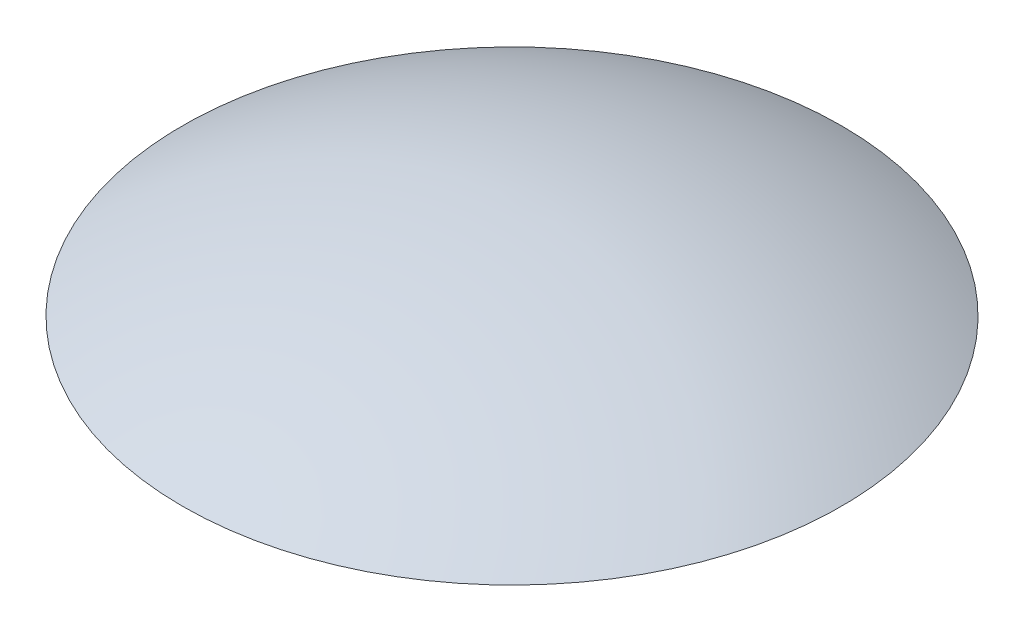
ISO-10303-21;
HEADER;
FILE_DESCRIPTION(('STEP AP214'),'2;1');
FILE_NAME('part.step','',(''),(''),'','','');
FILE_SCHEMA(('AUTOMOTIVE_DESIGN { 1 0 10303 214 1 1 1 1 }'));
ENDSEC;
DATA;
#1=APPLICATION_CONTEXT('core data for automotive mechanical design processes');
#2=APPLICATION_PROTOCOL_DEFINITION('international standard','automotive_design',2000,#1);
#3=PRODUCT_CONTEXT('',#1,'mechanical');
#4=PRODUCT('Part','Part','',(#3));
#5=PRODUCT_RELATED_PRODUCT_CATEGORY('part','',(#4));
#6=PRODUCT_DEFINITION_FORMATION('','',#4);
#7=PRODUCT_DEFINITION_CONTEXT('part definition',#1,'design');
#8=PRODUCT_DEFINITION('design','',#6,#7);
#9=PRODUCT_DEFINITION_SHAPE('','',#8);
#10=(LENGTH_UNIT() NAMED_UNIT(*) SI_UNIT(.MILLI.,.METRE.));
#11=(NAMED_UNIT(*) PLANE_ANGLE_UNIT() SI_UNIT($,.RADIAN.));
#12=(NAMED_UNIT(*) SI_UNIT($,.STERADIAN.) SOLID_ANGLE_UNIT());
#13=UNCERTAINTY_MEASURE_WITH_UNIT(LENGTH_MEASURE(1.E-05),#10,'distance_accuracy_value','');
#14=(GEOMETRIC_REPRESENTATION_CONTEXT(3) GLOBAL_UNCERTAINTY_ASSIGNED_CONTEXT((#13)) GLOBAL_UNIT_ASSIGNED_CONTEXT((#10,
#11,#12)) REPRESENTATION_CONTEXT('',''));
#15=CARTESIAN_POINT('',(0.,0.,0.));
#16=DIRECTION('',(0.,0.,1.));
#17=DIRECTION('',(1.,0.,0.));
#18=AXIS2_PLACEMENT_3D('',#15,#16,#17);
#19=CARTESIAN_POINT('',(0.,0.,0.));
#20=DIRECTION('',(0.,-1.,0.));
#21=DIRECTION('',(0.,0.,-1.));
#22=AXIS2_PLACEMENT_3D('',#19,#20,#21);
#23=PLANE('',#22);
#24=DIRECTION('',(0.,0.,1.));
#25=VECTOR('',#24,1.);
#26=CARTESIAN_POINT('',(-0.749999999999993,0.,-16.6414213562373));
#27=LINE('',#26,#25);
#28=CARTESIAN_POINT('',(-0.749999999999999,0.,0.750000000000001));
#29=VERTEX_POINT('',#28);
#30=CARTESIAN_POINT('',(-0.75,0.,3.));
#31=VERTEX_POINT('',#30);
#32=EDGE_CURVE('E117',#29,#31,#27,.T.);
#33=ORIENTED_EDGE('',*,*,#32,.T.);
#34=DIRECTION('',(1.,0.,0.));
#35=VECTOR('',#34,1.);
#36=CARTESIAN_POINT('',(0.,0.,3.));
#37=LINE('',#36,#35);
#38=CARTESIAN_POINT('',(0.75,0.,3.));
#39=VERTEX_POINT('',#38);
#40=EDGE_CURVE('E121',#31,#39,#37,.T.);
#41=ORIENTED_EDGE('',*,*,#40,.T.);
#42=DIRECTION('',(0.,0.,-1.));
#43=VECTOR('',#42,1.);
#44=CARTESIAN_POINT('',(0.750000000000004,0.,-16.6414213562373));
#45=LINE('',#44,#43);
#46=CARTESIAN_POINT('',(0.750000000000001,0.,0.750000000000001));
#47=VERTEX_POINT('',#46);
#48=EDGE_CURVE('E138',#39,#47,#45,.T.);
#49=ORIENTED_EDGE('',*,*,#48,.T.);
#50=DIRECTION('',(1.,0.,0.));
#51=VECTOR('',#50,1.);
#52=CARTESIAN_POINT('',(0.,0.,0.750000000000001));
#53=LINE('',#52,#51);
#54=CARTESIAN_POINT('',(3.,0.,0.750000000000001));
#55=VERTEX_POINT('',#54);
#56=EDGE_CURVE('E142',#47,#55,#53,.T.);
#57=ORIENTED_EDGE('',*,*,#56,.T.);
#58=DIRECTION('',(0.,0.,-1.));
#59=VECTOR('',#58,1.);
#60=CARTESIAN_POINT('',(3.,0.,-16.6414213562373));
#61=LINE('',#60,#59);
#62=CARTESIAN_POINT('',(3.,0.,-0.749999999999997));
#63=VERTEX_POINT('',#62);
#64=EDGE_CURVE('E210',#55,#63,#61,.T.);
#65=ORIENTED_EDGE('',*,*,#64,.T.);
#66=DIRECTION('',(-1.,0.,0.));
#67=VECTOR('',#66,1.);
#68=CARTESIAN_POINT('',(0.,0.,-0.750000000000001));
#69=LINE('',#68,#67);
#70=CARTESIAN_POINT('',(0.750000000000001,0.,-0.750000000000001));
#71=VERTEX_POINT('',#70);
#72=EDGE_CURVE('E216',#63,#71,#69,.T.);
#73=ORIENTED_EDGE('',*,*,#72,.T.);
#74=DIRECTION('',(0.,0.,-1.));
#75=VECTOR('',#74,1.);
#76=CARTESIAN_POINT('',(0.75,0.,-16.6414213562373));
#77=LINE('',#76,#75);
#78=CARTESIAN_POINT('',(0.750000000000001,0.,-3.));
#79=VERTEX_POINT('',#78);
#80=EDGE_CURVE('E218',#71,#79,#77,.T.);
#81=ORIENTED_EDGE('',*,*,#80,.T.);
#82=DIRECTION('',(1.,0.,0.));
#83=VECTOR('',#82,1.);
#84=CARTESIAN_POINT('',(0.,0.,-3.));
#85=LINE('',#84,#83);
#86=CARTESIAN_POINT('',(-0.749999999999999,0.,-3.));
#87=VERTEX_POINT('',#86);
#88=EDGE_CURVE('E222',#87,#79,#85,.T.);
#89=ORIENTED_EDGE('',*,*,#88,.F.);
#90=DIRECTION('',(0.,0.,1.));
#91=VECTOR('',#90,1.);
#92=CARTESIAN_POINT('',(-0.749999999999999,0.,-16.6414213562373));
#93=LINE('',#92,#91);
#94=CARTESIAN_POINT('',(-0.749999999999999,0.,-0.750000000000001));
#95=VERTEX_POINT('',#94);
#96=EDGE_CURVE('E225',#87,#95,#93,.T.);
#97=ORIENTED_EDGE('',*,*,#96,.T.);
#98=DIRECTION('',(-1.,0.,0.));
#99=VECTOR('',#98,1.);
#100=CARTESIAN_POINT('',(0.,0.,-0.750000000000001));
#101=LINE('',#100,#99);
#102=CARTESIAN_POINT('',(-3.,0.,-0.750000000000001));
#103=VERTEX_POINT('',#102);
#104=EDGE_CURVE('E227',#95,#103,#101,.T.);
#105=ORIENTED_EDGE('',*,*,#104,.T.);
#106=DIRECTION('',(0.,0.,-1.));
#107=VECTOR('',#106,1.);
#108=CARTESIAN_POINT('',(-3.,0.,-16.6414213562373));
#109=LINE('',#108,#107);
#110=CARTESIAN_POINT('',(-3.,0.,0.749999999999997));
#111=VERTEX_POINT('',#110);
#112=EDGE_CURVE('E51',#111,#103,#109,.T.);
#113=ORIENTED_EDGE('',*,*,#112,.F.);
#114=DIRECTION('',(1.,0.,0.));
#115=VECTOR('',#114,1.);
#116=CARTESIAN_POINT('',(0.,0.,0.750000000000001));
#117=LINE('',#116,#115);
#118=EDGE_CURVE('E46',#111,#29,#117,.T.);
#119=ORIENTED_EDGE('',*,*,#118,.T.);
#120=EDGE_LOOP('',(#33,#41,#49,#57,#65,#73,#81,#89,#97,#105,#113,#119));
#121=FACE_BOUND('',#120,.T.);
#122=CARTESIAN_POINT('',(0.,0.,0.));
#123=DIRECTION('',(0.,1.,0.));
#124=DIRECTION('',(0.,0.,1.));
#125=AXIS2_PLACEMENT_3D('',#122,#123,#124);
#126=CIRCLE('',#125,7.5);
#127=CARTESIAN_POINT('',(0.,0.,7.5));
#128=VERTEX_POINT('',#127);
#129=EDGE_CURVE('E11',#128,#128,#126,.T.);
#130=ORIENTED_EDGE('',*,*,#129,.F.);
#131=EDGE_LOOP('',(#130));
#132=FACE_BOUND('',#131,.T.);
#133=ADVANCED_FACE('F32',(#121,#132),#23,.T.);
#134=CARTESIAN_POINT('',(0.,-13.0625,0.));
#135=DIRECTION('',(0.,1.,0.));
#136=DIRECTION('',(0.,0.,-1.));
#137=AXIS2_PLACEMENT_3D('',#134,#135,#136);
#138=SPHERICAL_SURFACE('',#137,15.0625);
#139=ORIENTED_EDGE('',*,*,#129,.T.);
#140=EDGE_LOOP('',(#139));
#141=FACE_BOUND('',#140,.T.);
#142=ADVANCED_FACE('F263',(#141),#138,.T.);
#143=CARTESIAN_POINT('',(-0.749999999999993,0.,-16.6414213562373));
#144=DIRECTION('',(-0.996194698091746,-0.0871557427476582,0.));
#145=DIRECTION('',(0.0871557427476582,-0.996194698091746,0.));
#146=AXIS2_PLACEMENT_3D('',#143,#144,#145);
#147=PLANE('',#146);
#148=ORIENTED_EDGE('',*,*,#32,.F.);
#149=DIRECTION('',(-0.0868265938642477,0.992432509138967,0.0868265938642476));
#150=VECTOR('',#149,1.);
#151=CARTESIAN_POINT('',(-0.618888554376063,-1.49861068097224,0.618888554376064));
#152=LINE('',#151,#150);
#153=CARTESIAN_POINT('',(-0.575022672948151,-2.,0.575022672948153));
#154=VERTEX_POINT('',#153);
#155=EDGE_CURVE('E39',#154,#29,#152,.T.);
#156=ORIENTED_EDGE('',*,*,#155,.F.);
#157=DIRECTION('',(0.,0.,1.));
#158=VECTOR('',#157,1.);
#159=CARTESIAN_POINT('',(-0.575022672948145,-2.,-16.6414213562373));
#160=LINE('',#159,#158);
#161=CARTESIAN_POINT('',(-0.575022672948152,-2.,2.82502267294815));
#162=VERTEX_POINT('',#161);
#163=EDGE_CURVE('E129',#154,#162,#160,.T.);
#164=ORIENTED_EDGE('',*,*,#163,.T.);
#165=DIRECTION('',(-0.0868265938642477,0.992432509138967,0.0868265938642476));
#166=VECTOR('',#165,1.);
#167=CARTESIAN_POINT('',(-0.601926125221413,-1.69249213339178,2.85192612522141));
#168=LINE('',#167,#166);
#169=EDGE_CURVE('E126',#162,#31,#168,.T.);
#170=ORIENTED_EDGE('',*,*,#169,.T.);
#171=EDGE_LOOP('',(#148,#156,#164,#170));
#172=FACE_BOUND('',#171,.T.);
#173=ADVANCED_FACE('F127',(#172),#147,.T.);
#174=CARTESIAN_POINT('',(0.,0.,0.750000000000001));
#175=DIRECTION('',(0.,-0.0871557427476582,0.996194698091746));
#176=DIRECTION('',(0.,-0.996194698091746,-0.0871557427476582));
#177=AXIS2_PLACEMENT_3D('',#174,#175,#176);
#178=PLANE('',#177);
#179=ORIENTED_EDGE('',*,*,#118,.F.);
#180=DIRECTION('',(0.0868265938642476,-0.992432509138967,-0.0868265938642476));
#181=VECTOR('',#180,1.);
#182=CARTESIAN_POINT('',(-2.9773834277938,-0.258508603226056,0.7273834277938));
#183=LINE('',#182,#181);
#184=CARTESIAN_POINT('',(-2.82502267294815,-2.,0.575022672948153));
#185=VERTEX_POINT('',#184);
#186=EDGE_CURVE('E146',#185,#111,#183,.F.);
#187=ORIENTED_EDGE('',*,*,#186,.F.);
#188=DIRECTION('',(1.,0.,0.));
#189=VECTOR('',#188,1.);
#190=CARTESIAN_POINT('',(0.,-2.,0.575022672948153));
#191=LINE('',#190,#189);
#192=EDGE_CURVE('E140',#185,#154,#191,.T.);
#193=ORIENTED_EDGE('',*,*,#192,.T.);
#194=ORIENTED_EDGE('',*,*,#155,.T.);
#195=EDGE_LOOP('',(#179,#187,#193,#194));
#196=FACE_BOUND('',#195,.T.);
#197=ADVANCED_FACE('F235',(#196),#178,.T.);
#198=CARTESIAN_POINT('',(-3.,0.,-16.6414213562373));
#199=DIRECTION('',(-0.996194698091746,-0.0871557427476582,0.));
#200=DIRECTION('',(0.0871557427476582,-0.996194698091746,0.));
#201=AXIS2_PLACEMENT_3D('',#198,#199,#200);
#202=PLANE('',#201);
#203=ORIENTED_EDGE('',*,*,#112,.T.);
#204=DIRECTION('',(0.0868265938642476,-0.992432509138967,0.0868265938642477));
#205=VECTOR('',#204,1.);
#206=CARTESIAN_POINT('',(-3.11980315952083,1.36935637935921,-0.869803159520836));
#207=LINE('',#206,#205);
#208=CARTESIAN_POINT('',(-2.82502267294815,-2.,-0.575022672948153));
#209=VERTEX_POINT('',#208);
#210=EDGE_CURVE('E170',#209,#103,#207,.F.);
#211=ORIENTED_EDGE('',*,*,#210,.F.);
#212=DIRECTION('',(0.,0.,1.));
#213=VECTOR('',#212,1.);
#214=CARTESIAN_POINT('',(-2.82502267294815,-2.,-16.6414213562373));
#215=LINE('',#214,#213);
#216=EDGE_CURVE('E176',#185,#209,#215,.F.);
#217=ORIENTED_EDGE('',*,*,#216,.F.);
#218=ORIENTED_EDGE('',*,*,#186,.T.);
#219=EDGE_LOOP('',(#203,#211,#217,#218));
#220=FACE_BOUND('',#219,.T.);
#221=ADVANCED_FACE('F232',(#220),#202,.T.);
#222=CARTESIAN_POINT('',(0.,0.,-0.750000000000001));
#223=DIRECTION('',(0.,-0.0871557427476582,-0.996194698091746));
#224=DIRECTION('',(0.,0.996194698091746,-0.0871557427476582));
#225=AXIS2_PLACEMENT_3D('',#222,#223,#224);
#226=PLANE('',#225);
#227=ORIENTED_EDGE('',*,*,#104,.F.);
#228=DIRECTION('',(-0.0868265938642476,0.992432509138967,-0.0868265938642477));
#229=VECTOR('',#228,1.);
#230=CARTESIAN_POINT('',(-0.744345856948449,-0.0646271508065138,-0.74434585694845));
#231=LINE('',#230,#229);
#232=CARTESIAN_POINT('',(-0.575022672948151,-2.,-0.575022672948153));
#233=VERTEX_POINT('',#232);
#234=EDGE_CURVE('E167',#233,#95,#231,.T.);
#235=ORIENTED_EDGE('',*,*,#234,.F.);
#236=DIRECTION('',(-1.,0.,0.));
#237=VECTOR('',#236,1.);
#238=CARTESIAN_POINT('',(0.,-2.,-0.575022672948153));
#239=LINE('',#238,#237);
#240=EDGE_CURVE('E178',#233,#209,#239,.T.);
#241=ORIENTED_EDGE('',*,*,#240,.T.);
#242=ORIENTED_EDGE('',*,*,#210,.T.);
#243=EDGE_LOOP('',(#227,#235,#241,#242));
#244=FACE_BOUND('',#243,.T.);
#245=ADVANCED_FACE('F277',(#244),#226,.T.);
#246=CARTESIAN_POINT('',(-0.749999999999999,0.,-16.6414213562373));
#247=DIRECTION('',(-0.996194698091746,-0.0871557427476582,0.));
#248=DIRECTION('',(0.0871557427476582,-0.996194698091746,0.));
#249=AXIS2_PLACEMENT_3D('',#246,#247,#248);
#250=PLANE('',#249);
#251=ORIENTED_EDGE('',*,*,#96,.F.);
#252=DIRECTION('',(0.0868265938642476,-0.992432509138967,0.0868265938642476));
#253=VECTOR('',#252,1.);
#254=CARTESIAN_POINT('',(-0.852840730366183,1.17547492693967,-3.10284073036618));
#255=LINE('',#254,#253);
#256=CARTESIAN_POINT('',(-0.575022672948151,-2.,-2.82502267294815));
#257=VERTEX_POINT('',#256);
#258=EDGE_CURVE('E164',#257,#87,#255,.F.);
#259=ORIENTED_EDGE('',*,*,#258,.F.);
#260=DIRECTION('',(0.,0.,1.));
#261=VECTOR('',#260,1.);
#262=CARTESIAN_POINT('',(-0.575022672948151,-2.,-16.6414213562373));
#263=LINE('',#262,#261);
#264=EDGE_CURVE('E181',#257,#233,#263,.T.);
#265=ORIENTED_EDGE('',*,*,#264,.T.);
#266=ORIENTED_EDGE('',*,*,#234,.T.);
#267=EDGE_LOOP('',(#251,#259,#265,#266));
#268=FACE_BOUND('',#267,.T.);
#269=ADVANCED_FACE('F241',(#268),#250,.T.);
#270=CARTESIAN_POINT('',(0.,0.,-3.));
#271=DIRECTION('',(0.,-0.0871557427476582,-0.996194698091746));
#272=DIRECTION('',(0.,0.996194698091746,-0.0871557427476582));
#273=AXIS2_PLACEMENT_3D('',#270,#271,#272);
#274=PLANE('',#273);
#275=ORIENTED_EDGE('',*,*,#88,.T.);
#276=DIRECTION('',(-0.0868265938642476,-0.992432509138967,0.0868265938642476));
#277=VECTOR('',#276,1.);
#278=CARTESIAN_POINT('',(0.744345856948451,-0.064627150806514,-2.99434585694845));
#279=LINE('',#278,#277);
#280=CARTESIAN_POINT('',(0.575022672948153,-2.,-2.82502267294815));
#281=VERTEX_POINT('',#280);
#282=EDGE_CURVE('E161',#281,#79,#279,.F.);
#283=ORIENTED_EDGE('',*,*,#282,.F.);
#284=DIRECTION('',(-1.,0.,0.));
#285=VECTOR('',#284,1.);
#286=CARTESIAN_POINT('',(0.,-2.,-2.82502267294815));
#287=LINE('',#286,#285);
#288=EDGE_CURVE('E184',#257,#281,#287,.F.);
#289=ORIENTED_EDGE('',*,*,#288,.F.);
#290=ORIENTED_EDGE('',*,*,#258,.T.);
#291=EDGE_LOOP('',(#275,#283,#289,#290));
#292=FACE_BOUND('',#291,.T.);
#293=ADVANCED_FACE('F246',(#292),#274,.T.);
#294=CARTESIAN_POINT('',(0.75,0.,-16.6414213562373));
#295=DIRECTION('',(0.996194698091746,-0.0871557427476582,0.));
#296=DIRECTION('',(0.0871557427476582,0.996194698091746,0.));
#297=AXIS2_PLACEMENT_3D('',#294,#295,#296);
#298=PLANE('',#297);
#299=ORIENTED_EDGE('',*,*,#80,.F.);
#300=DIRECTION('',(0.0868265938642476,0.992432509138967,-0.0868265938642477));
#301=VECTOR('',#300,1.);
#302=CARTESIAN_POINT('',(0.869803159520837,1.36935637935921,-0.869803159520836));
#303=LINE('',#302,#301);
#304=CARTESIAN_POINT('',(0.575022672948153,-2.,-0.575022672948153));
#305=VERTEX_POINT('',#304);
#306=EDGE_CURVE('E158',#305,#71,#303,.T.);
#307=ORIENTED_EDGE('',*,*,#306,.F.);
#308=DIRECTION('',(0.,0.,-1.));
#309=VECTOR('',#308,1.);
#310=CARTESIAN_POINT('',(0.575022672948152,-2.,-16.6414213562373));
#311=LINE('',#310,#309);
#312=EDGE_CURVE('E186',#305,#281,#311,.T.);
#313=ORIENTED_EDGE('',*,*,#312,.T.);
#314=ORIENTED_EDGE('',*,*,#282,.T.);
#315=EDGE_LOOP('',(#299,#307,#313,#314));
#316=FACE_BOUND('',#315,.T.);
#317=ADVANCED_FACE('F253',(#316),#298,.T.);
#318=CARTESIAN_POINT('',(0.,0.,-0.750000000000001));
#319=DIRECTION('',(0.,-0.0871557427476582,-0.996194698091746));
#320=DIRECTION('',(0.,0.996194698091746,-0.0871557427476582));
#321=AXIS2_PLACEMENT_3D('',#318,#319,#320);
#322=PLANE('',#321);
#323=ORIENTED_EDGE('',*,*,#72,.F.);
#324=DIRECTION('',(0.0868265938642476,0.992432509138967,-0.0868265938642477));
#325=VECTOR('',#324,1.);
#326=CARTESIAN_POINT('',(3.11980315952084,1.36935637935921,-0.869803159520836));
#327=LINE('',#326,#325);
#328=CARTESIAN_POINT('',(2.82502267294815,-2.,-0.575022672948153));
#329=VERTEX_POINT('',#328);
#330=EDGE_CURVE('E155',#329,#63,#327,.T.);
#331=ORIENTED_EDGE('',*,*,#330,.F.);
#332=DIRECTION('',(-1.,0.,0.));
#333=VECTOR('',#332,1.);
#334=CARTESIAN_POINT('',(0.,-2.,-0.575022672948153));
#335=LINE('',#334,#333);
#336=EDGE_CURVE('E189',#329,#305,#335,.T.);
#337=ORIENTED_EDGE('',*,*,#336,.T.);
#338=ORIENTED_EDGE('',*,*,#306,.T.);
#339=EDGE_LOOP('',(#323,#331,#337,#338));
#340=FACE_BOUND('',#339,.T.);
#341=ADVANCED_FACE('F251',(#340),#322,.T.);
#342=CARTESIAN_POINT('',(3.,0.,-16.6414213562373));
#343=DIRECTION('',(0.996194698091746,-0.0871557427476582,0.));
#344=DIRECTION('',(0.0871557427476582,0.996194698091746,0.));
#345=AXIS2_PLACEMENT_3D('',#342,#343,#344);
#346=PLANE('',#345);
#347=ORIENTED_EDGE('',*,*,#64,.F.);
#348=DIRECTION('',(0.0868265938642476,0.992432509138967,0.0868265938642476));
#349=VECTOR('',#348,1.);
#350=CARTESIAN_POINT('',(2.9773834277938,-0.258508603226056,0.7273834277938));
#351=LINE('',#350,#349);
#352=CARTESIAN_POINT('',(2.82502267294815,-2.,0.575022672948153));
#353=VERTEX_POINT('',#352);
#354=EDGE_CURVE('E152',#353,#55,#351,.T.);
#355=ORIENTED_EDGE('',*,*,#354,.F.);
#356=DIRECTION('',(0.,0.,-1.));
#357=VECTOR('',#356,1.);
#358=CARTESIAN_POINT('',(2.82502267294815,-2.,-16.6414213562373));
#359=LINE('',#358,#357);
#360=EDGE_CURVE('E192',#353,#329,#359,.T.);
#361=ORIENTED_EDGE('',*,*,#360,.T.);
#362=ORIENTED_EDGE('',*,*,#330,.T.);
#363=EDGE_LOOP('',(#347,#355,#361,#362));
#364=FACE_BOUND('',#363,.T.);
#365=ADVANCED_FACE('F214',(#364),#346,.T.);
#366=CARTESIAN_POINT('',(0.,0.,0.750000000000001));
#367=DIRECTION('',(0.,-0.0871557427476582,0.996194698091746));
#368=DIRECTION('',(0.,-0.996194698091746,-0.0871557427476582));
#369=AXIS2_PLACEMENT_3D('',#366,#367,#368);
#370=PLANE('',#369);
#371=ORIENTED_EDGE('',*,*,#56,.F.);
#372=DIRECTION('',(0.0868265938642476,0.992432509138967,0.0868265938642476));
#373=VECTOR('',#372,1.);
#374=CARTESIAN_POINT('',(0.744345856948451,-0.064627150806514,0.74434585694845));
#375=LINE('',#374,#373);
#376=CARTESIAN_POINT('',(0.575022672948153,-2.,0.575022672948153));
#377=VERTEX_POINT('',#376);
#378=EDGE_CURVE('E149',#377,#47,#375,.T.);
#379=ORIENTED_EDGE('',*,*,#378,.F.);
#380=DIRECTION('',(1.,0.,0.));
#381=VECTOR('',#380,1.);
#382=CARTESIAN_POINT('',(0.,-2.,0.575022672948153));
#383=LINE('',#382,#381);
#384=EDGE_CURVE('E195',#377,#353,#383,.T.);
#385=ORIENTED_EDGE('',*,*,#384,.T.);
#386=ORIENTED_EDGE('',*,*,#354,.T.);
#387=EDGE_LOOP('',(#371,#379,#385,#386));
#388=FACE_BOUND('',#387,.T.);
#389=ADVANCED_FACE('F212',(#388),#370,.T.);
#390=CARTESIAN_POINT('',(0.750000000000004,0.,-16.6414213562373));
#391=DIRECTION('',(0.996194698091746,-0.0871557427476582,0.));
#392=DIRECTION('',(0.0871557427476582,0.996194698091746,0.));
#393=AXIS2_PLACEMENT_3D('',#390,#391,#392);
#394=PLANE('',#393);
#395=ORIENTED_EDGE('',*,*,#48,.F.);
#396=DIRECTION('',(0.0868265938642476,0.992432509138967,0.0868265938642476));
#397=VECTOR('',#396,1.);
#398=CARTESIAN_POINT('',(0.74434585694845,-0.064627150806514,2.99434585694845));
#399=LINE('',#398,#397);
#400=CARTESIAN_POINT('',(0.575022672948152,-2.,2.82502267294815));
#401=VERTEX_POINT('',#400);
#402=EDGE_CURVE('E133',#401,#39,#399,.T.);
#403=ORIENTED_EDGE('',*,*,#402,.F.);
#404=DIRECTION('',(0.,0.,-1.));
#405=VECTOR('',#404,1.);
#406=CARTESIAN_POINT('',(0.575022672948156,-2.,-16.6414213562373));
#407=LINE('',#406,#405);
#408=EDGE_CURVE('E198',#401,#377,#407,.T.);
#409=ORIENTED_EDGE('',*,*,#408,.T.);
#410=ORIENTED_EDGE('',*,*,#378,.T.);
#411=EDGE_LOOP('',(#395,#403,#409,#410));
#412=FACE_BOUND('',#411,.T.);
#413=ADVANCED_FACE('F207',(#412),#394,.T.);
#414=CARTESIAN_POINT('',(0.,0.,3.));
#415=DIRECTION('',(0.,-0.0871557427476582,0.996194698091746));
#416=DIRECTION('',(0.,-0.996194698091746,-0.0871557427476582));
#417=AXIS2_PLACEMENT_3D('',#414,#415,#416);
#418=PLANE('',#417);
#419=ORIENTED_EDGE('',*,*,#40,.F.);
#420=ORIENTED_EDGE('',*,*,#169,.F.);
#421=DIRECTION('',(1.,0.,0.));
#422=VECTOR('',#421,1.);
#423=CARTESIAN_POINT('',(0.,-2.,2.82502267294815));
#424=LINE('',#423,#422);
#425=EDGE_CURVE('E134',#162,#401,#424,.T.);
#426=ORIENTED_EDGE('',*,*,#425,.T.);
#427=ORIENTED_EDGE('',*,*,#402,.T.);
#428=EDGE_LOOP('',(#419,#420,#426,#427));
#429=FACE_BOUND('',#428,.T.);
#430=ADVANCED_FACE('F136',(#429),#418,.T.);
#431=CARTESIAN_POINT('',(0.,-2.,-16.6414213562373));
#432=DIRECTION('',(0.,-1.,0.));
#433=DIRECTION('',(0.,0.,-1.));
#434=AXIS2_PLACEMENT_3D('',#431,#432,#433);
#435=PLANE('',#434);
#436=ORIENTED_EDGE('',*,*,#163,.F.);
#437=ORIENTED_EDGE('',*,*,#192,.F.);
#438=ORIENTED_EDGE('',*,*,#216,.T.);
#439=ORIENTED_EDGE('',*,*,#240,.F.);
#440=ORIENTED_EDGE('',*,*,#264,.F.);
#441=ORIENTED_EDGE('',*,*,#288,.T.);
#442=ORIENTED_EDGE('',*,*,#312,.F.);
#443=ORIENTED_EDGE('',*,*,#336,.F.);
#444=ORIENTED_EDGE('',*,*,#360,.F.);
#445=ORIENTED_EDGE('',*,*,#384,.F.);
#446=ORIENTED_EDGE('',*,*,#408,.F.);
#447=ORIENTED_EDGE('',*,*,#425,.F.);
#448=EDGE_LOOP('',(#436,#437,#438,#439,#440,#441,#442,#443,#444,#445,#446,#447));
#449=FACE_BOUND('',#448,.T.);
#450=ADVANCED_FACE('F202',(#449),#435,.T.);
#451=CLOSED_SHELL('',(#133,#142,#173,#197,#221,#245,#269,#293,#317,#341,#365,#389,#413,#430,#450));
#452=MANIFOLD_SOLID_BREP('B2',#451);
#453=ADVANCED_BREP_SHAPE_REPRESENTATION('',(#18,#452),#14);
#454=SHAPE_DEFINITION_REPRESENTATION(#9,#453);
ENDSEC;
END-ISO-10303-21;
